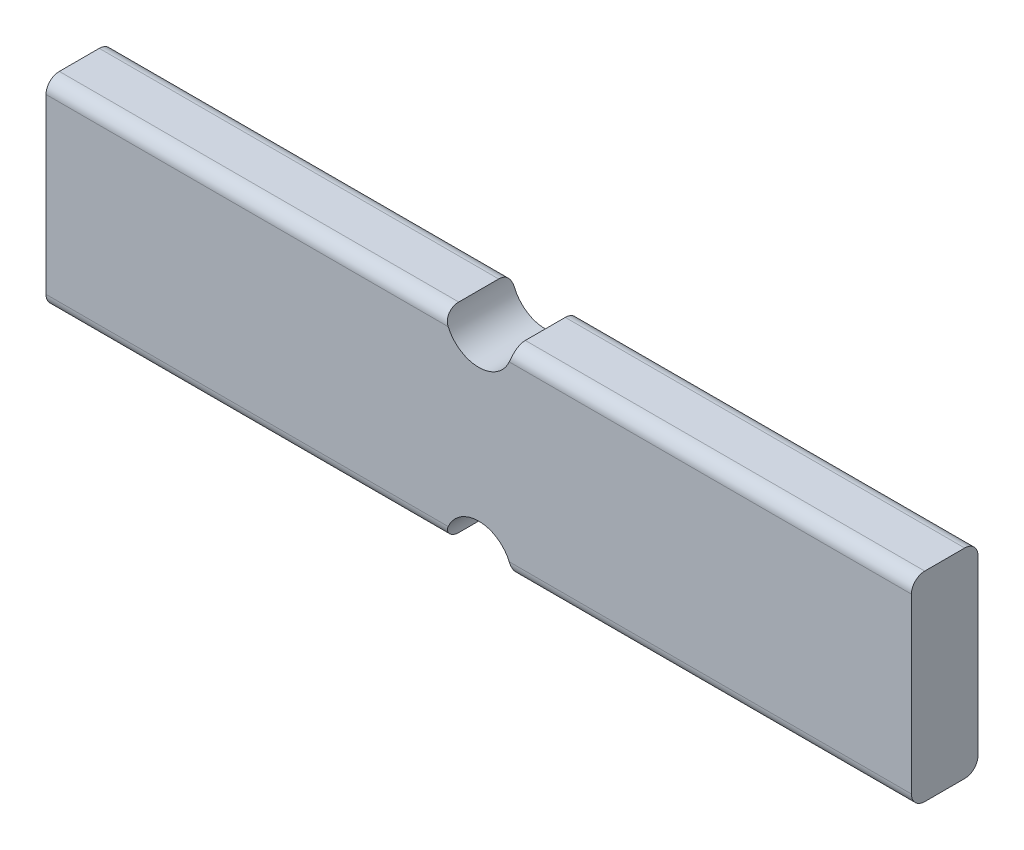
ISO-10303-21;
HEADER;
FILE_DESCRIPTION(('STEP AP214'),'2;1');
FILE_NAME('part.step','',(''),(''),'','','');
FILE_SCHEMA(('AUTOMOTIVE_DESIGN { 1 0 10303 214 1 1 1 1 }'));
ENDSEC;
DATA;
#1=APPLICATION_CONTEXT('core data for automotive mechanical design processes');
#2=APPLICATION_PROTOCOL_DEFINITION('international standard','automotive_design',2000,#1);
#3=PRODUCT_CONTEXT('',#1,'mechanical');
#4=PRODUCT('Part','Part','',(#3));
#5=PRODUCT_RELATED_PRODUCT_CATEGORY('part','',(#4));
#6=PRODUCT_DEFINITION_FORMATION('','',#4);
#7=PRODUCT_DEFINITION_CONTEXT('part definition',#1,'design');
#8=PRODUCT_DEFINITION('design','',#6,#7);
#9=PRODUCT_DEFINITION_SHAPE('','',#8);
#10=(LENGTH_UNIT() NAMED_UNIT(*) SI_UNIT(.MILLI.,.METRE.));
#11=(NAMED_UNIT(*) PLANE_ANGLE_UNIT() SI_UNIT($,.RADIAN.));
#12=(NAMED_UNIT(*) SI_UNIT($,.STERADIAN.) SOLID_ANGLE_UNIT());
#13=UNCERTAINTY_MEASURE_WITH_UNIT(LENGTH_MEASURE(1.E-05),#10,'distance_accuracy_value','');
#14=(GEOMETRIC_REPRESENTATION_CONTEXT(3) GLOBAL_UNCERTAINTY_ASSIGNED_CONTEXT((#13)) GLOBAL_UNIT_ASSIGNED_CONTEXT((#10,
#11,#12)) REPRESENTATION_CONTEXT('',''));
#15=CARTESIAN_POINT('',(0.,0.,0.));
#16=DIRECTION('',(0.,0.,1.));
#17=DIRECTION('',(1.,0.,0.));
#18=AXIS2_PLACEMENT_3D('',#15,#16,#17);
#19=CARTESIAN_POINT('',(0.,0.,12.7));
#20=DIRECTION('',(1.,0.,0.));
#21=DIRECTION('',(0.,0.,-1.));
#22=AXIS2_PLACEMENT_3D('',#19,#20,#21);
#23=PLANE('',#22);
#24=DIRECTION('',(0.,-1.,0.));
#25=VECTOR('',#24,1.);
#26=CARTESIAN_POINT('',(0.,0.,0.));
#27=LINE('',#26,#25);
#28=CARTESIAN_POINT('',(0.,35.56,0.));
#29=VERTEX_POINT('',#28);
#30=CARTESIAN_POINT('',(0.,2.54,0.));
#31=VERTEX_POINT('',#30);
#32=EDGE_CURVE('E258',#29,#31,#27,.T.);
#33=ORIENTED_EDGE('',*,*,#32,.T.);
#34=CARTESIAN_POINT('',(0.,2.54,2.54));
#35=DIRECTION('',(1.,0.,0.));
#36=DIRECTION('',(0.,0.,-1.));
#37=AXIS2_PLACEMENT_3D('',#34,#35,#36);
#38=CIRCLE('',#37,2.54);
#39=CARTESIAN_POINT('',(0.,0.,2.54));
#40=VERTEX_POINT('',#39);
#41=EDGE_CURVE('E261',#31,#40,#38,.F.);
#42=ORIENTED_EDGE('',*,*,#41,.T.);
#43=DIRECTION('',(0.,0.,-1.));
#44=VECTOR('',#43,1.);
#45=CARTESIAN_POINT('',(0.,0.,12.7));
#46=LINE('',#45,#44);
#47=CARTESIAN_POINT('',(0.,0.,10.16));
#48=VERTEX_POINT('',#47);
#49=EDGE_CURVE('E178',#48,#40,#46,.T.);
#50=ORIENTED_EDGE('',*,*,#49,.F.);
#51=CARTESIAN_POINT('',(0.,2.54,10.16));
#52=DIRECTION('',(1.,0.,0.));
#53=DIRECTION('',(0.,0.,-1.));
#54=AXIS2_PLACEMENT_3D('',#51,#52,#53);
#55=CIRCLE('',#54,2.54);
#56=CARTESIAN_POINT('',(0.,2.54,12.7));
#57=VERTEX_POINT('',#56);
#58=EDGE_CURVE('E273',#48,#57,#55,.F.);
#59=ORIENTED_EDGE('',*,*,#58,.T.);
#60=DIRECTION('',(0.,-1.,0.));
#61=VECTOR('',#60,1.);
#62=CARTESIAN_POINT('',(0.,0.,12.7));
#63=LINE('',#62,#61);
#64=CARTESIAN_POINT('',(0.,35.56,12.7));
#65=VERTEX_POINT('',#64);
#66=EDGE_CURVE('E367',#65,#57,#63,.T.);
#67=ORIENTED_EDGE('',*,*,#66,.F.);
#68=CARTESIAN_POINT('',(0.,35.56,10.16));
#69=DIRECTION('',(1.,0.,0.));
#70=DIRECTION('',(0.,0.,-1.));
#71=AXIS2_PLACEMENT_3D('',#68,#69,#70);
#72=CIRCLE('',#71,2.54);
#73=CARTESIAN_POINT('',(0.,38.1,10.16));
#74=VERTEX_POINT('',#73);
#75=EDGE_CURVE('E362',#65,#74,#72,.F.);
#76=ORIENTED_EDGE('',*,*,#75,.T.);
#77=DIRECTION('',(0.,0.,-1.));
#78=VECTOR('',#77,1.);
#79=CARTESIAN_POINT('',(0.,38.1,12.7));
#80=LINE('',#79,#78);
#81=CARTESIAN_POINT('',(0.,38.1,2.54));
#82=VERTEX_POINT('',#81);
#83=EDGE_CURVE('E344',#74,#82,#80,.T.);
#84=ORIENTED_EDGE('',*,*,#83,.T.);
#85=CARTESIAN_POINT('',(0.,35.56,2.54));
#86=DIRECTION('',(1.,0.,0.));
#87=DIRECTION('',(0.,0.,-1.));
#88=AXIS2_PLACEMENT_3D('',#85,#86,#87);
#89=CIRCLE('',#88,2.54);
#90=EDGE_CURVE('E263',#82,#29,#89,.F.);
#91=ORIENTED_EDGE('',*,*,#90,.T.);
#92=EDGE_LOOP('',(#33,#42,#50,#59,#67,#76,#84,#91));
#93=FACE_BOUND('',#92,.T.);
#94=ADVANCED_FACE('F35',(#93),#23,.F.);
#95=CARTESIAN_POINT('',(0.,0.,12.7));
#96=DIRECTION('',(0.,1.,0.));
#97=DIRECTION('',(0.,0.,1.));
#98=AXIS2_PLACEMENT_3D('',#95,#96,#97);
#99=PLANE('',#98);
#100=ORIENTED_EDGE('',*,*,#49,.T.);
#101=DIRECTION('',(1.,0.,0.));
#102=VECTOR('',#101,1.);
#103=CARTESIAN_POINT('',(0.,0.,2.54));
#104=LINE('',#103,#102);
#105=CARTESIAN_POINT('',(76.2,0.,2.54));
#106=VERTEX_POINT('',#105);
#107=EDGE_CURVE('E271',#40,#106,#104,.T.);
#108=ORIENTED_EDGE('',*,*,#107,.T.);
#109=DIRECTION('',(0.,0.,-1.));
#110=VECTOR('',#109,1.);
#111=CARTESIAN_POINT('',(76.2,0.,12.7));
#112=LINE('',#111,#110);
#113=CARTESIAN_POINT('',(76.2,0.,10.16));
#114=VERTEX_POINT('',#113);
#115=EDGE_CURVE('E183',#114,#106,#112,.T.);
#116=ORIENTED_EDGE('',*,*,#115,.F.);
#117=DIRECTION('',(1.,0.,0.));
#118=VECTOR('',#117,1.);
#119=CARTESIAN_POINT('',(0.,0.,10.16));
#120=LINE('',#119,#118);
#121=EDGE_CURVE('E359',#114,#48,#120,.F.);
#122=ORIENTED_EDGE('',*,*,#121,.T.);
#123=EDGE_LOOP('',(#100,#108,#116,#122));
#124=FACE_BOUND('',#123,.T.);
#125=ADVANCED_FACE('F218',(#124),#99,.F.);
#126=CARTESIAN_POINT('',(82.55,0.,12.7));
#127=DIRECTION('',(0.,0.,-1.));
#128=DIRECTION('',(-1.,0.,0.));
#129=AXIS2_PLACEMENT_3D('',#126,#127,#128);
#130=CYLINDRICAL_SURFACE('',#129,6.34999999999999);
#131=CARTESIAN_POINT('',(82.55,0.,0.));
#132=DIRECTION('',(0.,0.,-1.));
#133=DIRECTION('',(1.,0.,0.));
#134=AXIS2_PLACEMENT_3D('',#131,#132,#133);
#135=CIRCLE('',#134,6.34999999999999);
#136=CARTESIAN_POINT('',(76.7301288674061,2.54,0.));
#137=VERTEX_POINT('',#136);
#138=CARTESIAN_POINT('',(88.3698711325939,2.54,0.));
#139=VERTEX_POINT('',#138);
#140=EDGE_CURVE('E266',#137,#139,#135,.T.);
#141=ORIENTED_EDGE('',*,*,#140,.T.);
#142=CARTESIAN_POINT('',(88.3698711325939,2.54,0.));
#143=CARTESIAN_POINT('',(88.3982470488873,2.47500677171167,-7.07022953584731E-06));
#144=CARTESIAN_POINT('',(88.4255214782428,2.40951933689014,0.00249496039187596));
#145=CARTESIAN_POINT('',(88.4777493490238,2.27799575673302,0.0126895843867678));
#146=CARTESIAN_POINT('',(88.5027018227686,2.21195939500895,0.0203843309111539));
#147=CARTESIAN_POINT('',(88.5501563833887,2.07979790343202,0.0411424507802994));
#148=CARTESIAN_POINT('',(88.5726571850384,2.01367274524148,0.0542086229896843));
#149=CARTESIAN_POINT('',(88.6151136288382,1.88193975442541,0.0857887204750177));
#150=CARTESIAN_POINT('',(88.6350696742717,1.81633184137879,0.104301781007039));
#151=CARTESIAN_POINT('',(88.6911804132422,1.6207226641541,0.168224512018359));
#152=CARTESIAN_POINT('',(88.723482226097,1.49220517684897,0.221976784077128));
#153=CARTESIAN_POINT('',(88.7781844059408,1.2443372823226,0.350850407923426));
#154=CARTESIAN_POINT('',(88.8005949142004,1.12497759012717,0.425949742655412));
#155=CARTESIAN_POINT('',(88.8362768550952,0.904028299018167,0.592293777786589));
#156=CARTESIAN_POINT('',(88.8498732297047,0.801924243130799,0.68278681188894));
#157=CARTESIAN_POINT('',(88.8710367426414,0.613219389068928,0.879368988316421));
#158=CARTESIAN_POINT('',(88.8786009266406,0.526626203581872,0.985465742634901));
#159=CARTESIAN_POINT('',(88.8896742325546,0.370483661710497,1.21185604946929));
#160=CARTESIAN_POINT('',(88.8931268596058,0.301181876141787,1.33232291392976));
#161=CARTESIAN_POINT('',(88.8976351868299,0.183130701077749,1.58294682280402));
#162=CARTESIAN_POINT('',(88.8986913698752,0.134377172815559,1.71310190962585));
#163=CARTESIAN_POINT('',(88.8997519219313,0.0645562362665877,1.95904725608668));
#164=CARTESIAN_POINT('',(88.8998933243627,0.0403796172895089,2.07395930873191));
#165=CARTESIAN_POINT('',(88.8999839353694,0.0161710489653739,2.24790357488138));
#166=CARTESIAN_POINT('',(88.8999938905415,0.0101109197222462,2.30614737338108));
#167=CARTESIAN_POINT('',(88.9000003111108,0.00202487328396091,2.42292189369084));
#168=CARTESIAN_POINT('',(88.8999967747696,-5.23935691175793E-07,2.48145265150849));
#169=CARTESIAN_POINT('',(88.9,0.,2.54));
#170=B_SPLINE_CURVE_WITH_KNOTS('',3,(#142,#143,#144,#145,#146,#147,#148,#149,#150,#151,#152,
#153,#154,#155,#156,#157,#158,#159,#160,#161,#162,#163,#164,#165,#166,#167,#168,#169),
.UNSPECIFIED.,.F.,.F.,(4,2,2,2,2,2,2,2,2,2,2,2,2,4),(0.,0.212715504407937,0.425519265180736,
0.638434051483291,0.851315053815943,1.27793134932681,1.70410922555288,2.1135158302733,
2.52312282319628,2.93829537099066,3.35338425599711,3.70449087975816,3.88004227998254,
4.05561630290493),.UNSPECIFIED.);
#171=CARTESIAN_POINT('',(88.9,0.,2.54));
#172=VERTEX_POINT('',#171);
#173=EDGE_CURVE('E231',#139,#172,#170,.T.);
#174=ORIENTED_EDGE('',*,*,#173,.T.);
#175=DIRECTION('',(0.,0.,-1.));
#176=VECTOR('',#175,1.);
#177=CARTESIAN_POINT('',(88.9,0.,12.7));
#178=LINE('',#177,#176);
#179=CARTESIAN_POINT('',(88.9,0.,10.16));
#180=VERTEX_POINT('',#179);
#181=EDGE_CURVE('E172',#180,#172,#178,.T.);
#182=ORIENTED_EDGE('',*,*,#181,.F.);
#183=CARTESIAN_POINT('',(88.9,0.,10.16));
#184=CARTESIAN_POINT('',(88.8999910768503,-6.78863674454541E-06,10.2313283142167));
#185=CARTESIAN_POINT('',(88.8999997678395,0.00300454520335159,10.3026533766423));
#186=CARTESIAN_POINT('',(88.8999874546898,0.0150108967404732,10.4447952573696));
#187=CARTESIAN_POINT('',(88.8999664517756,0.024005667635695,10.5156120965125));
#188=CARTESIAN_POINT('',(88.8998298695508,0.0479207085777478,10.6562086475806));
#189=CARTESIAN_POINT('',(88.8997143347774,0.0628381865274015,10.7259888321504));
#190=CARTESIAN_POINT('',(88.899261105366,0.0984775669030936,10.8640289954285));
#191=CARTESIAN_POINT('',(88.8989234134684,0.119199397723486,10.9322889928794));
#192=CARTESIAN_POINT('',(88.8973376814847,0.189908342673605,11.1341426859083));
#193=CARTESIAN_POINT('',(88.8955171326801,0.248446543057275,11.2648547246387));
#194=CARTESIAN_POINT('',(88.8885986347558,0.38653944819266,11.514464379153));
#195=CARTESIAN_POINT('',(88.883501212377,0.466090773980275,11.6333638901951));
#196=CARTESIAN_POINT('',(88.8679584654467,0.64321921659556,11.8552354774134));
#197=CARTESIAN_POINT('',(88.8575487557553,0.740673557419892,11.9583077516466));
#198=CARTESIAN_POINT('',(88.8293165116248,0.950723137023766,12.1463676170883));
#199=CARTESIAN_POINT('',(88.8114973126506,1.06331154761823,12.2313633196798));
#200=CARTESIAN_POINT('',(88.7673405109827,1.29648034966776,12.3789608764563));
#201=CARTESIAN_POINT('',(88.7412443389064,1.41676518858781,12.442102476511));
#202=CARTESIAN_POINT('',(88.6794762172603,1.66379400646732,12.5478693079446));
#203=CARTESIAN_POINT('',(88.6437998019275,1.79054097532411,12.5904849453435));
#204=CARTESIAN_POINT('',(88.5704500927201,2.02201394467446,12.6489247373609));
#205=CARTESIAN_POINT('',(88.5344210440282,2.12638700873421,12.6682849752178));
#206=CARTESIAN_POINT('',(88.4759315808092,2.28230592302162,12.6874364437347));
#207=CARTESIAN_POINT('',(88.455710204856,2.33413516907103,12.6921722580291));
#208=CARTESIAN_POINT('',(88.4138435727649,2.43740586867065,12.6984542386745));
#209=CARTESIAN_POINT('',(88.3921984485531,2.48884735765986,12.7000007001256));
#210=CARTESIAN_POINT('',(88.3698711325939,2.54,12.7));
#211=B_SPLINE_CURVE_WITH_KNOTS('',3,(#183,#184,#185,#186,#187,#188,#189,#190,#191,#192,#193,
#194,#195,#196,#197,#198,#199,#200,#201,#202,#203,#204,#205,#206,#207,#208,#209,#210),
.UNSPECIFIED.,.F.,.F.,(4,2,2,2,2,2,2,2,2,2,2,2,2,4),(0.,0.213915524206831,0.427822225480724,
0.641628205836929,0.855431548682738,1.28290407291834,1.71030790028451,2.1348832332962,
2.55926764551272,2.97226337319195,3.38545195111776,3.72074992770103,3.88815894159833,
4.05555246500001),.UNSPECIFIED.);
#212=CARTESIAN_POINT('',(88.3698711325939,2.54,12.7));
#213=VERTEX_POINT('',#212);
#214=EDGE_CURVE('E177',#180,#213,#211,.T.);
#215=ORIENTED_EDGE('',*,*,#214,.T.);
#216=CARTESIAN_POINT('',(82.55,0.,12.7));
#217=DIRECTION('',(0.,0.,-1.));
#218=DIRECTION('',(1.,0.,0.));
#219=AXIS2_PLACEMENT_3D('',#216,#217,#218);
#220=CIRCLE('',#219,6.34999999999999);
#221=CARTESIAN_POINT('',(76.7301288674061,2.54,12.7));
#222=VERTEX_POINT('',#221);
#223=EDGE_CURVE('E387',#222,#213,#220,.T.);
#224=ORIENTED_EDGE('',*,*,#223,.F.);
#225=CARTESIAN_POINT('',(76.7301288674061,2.54,12.7));
#226=CARTESIAN_POINT('',(76.7017529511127,2.47500677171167,12.7000070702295));
#227=CARTESIAN_POINT('',(76.6744785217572,2.40951933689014,12.6975050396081));
#228=CARTESIAN_POINT('',(76.6222506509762,2.27799575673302,12.6873104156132));
#229=CARTESIAN_POINT('',(76.5972981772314,2.21195939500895,12.6796156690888));
#230=CARTESIAN_POINT('',(76.5498436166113,2.07979790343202,12.6588575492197));
#231=CARTESIAN_POINT('',(76.5273428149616,2.01367274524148,12.6457913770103));
#232=CARTESIAN_POINT('',(76.4848863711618,1.88193975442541,12.614211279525));
#233=CARTESIAN_POINT('',(76.4649303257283,1.81633184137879,12.595698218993));
#234=CARTESIAN_POINT('',(76.4088195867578,1.6207226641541,12.5317754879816));
#235=CARTESIAN_POINT('',(76.376517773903,1.49220517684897,12.4780232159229));
#236=CARTESIAN_POINT('',(76.3218155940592,1.2443372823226,12.3491495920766));
#237=CARTESIAN_POINT('',(76.2994050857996,1.12497759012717,12.2740502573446));
#238=CARTESIAN_POINT('',(76.2637231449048,0.904028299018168,12.1077062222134));
#239=CARTESIAN_POINT('',(76.2501267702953,0.801924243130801,12.0172131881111));
#240=CARTESIAN_POINT('',(76.2289632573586,0.61321938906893,11.8206310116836));
#241=CARTESIAN_POINT('',(76.2213990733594,0.526626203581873,11.7145342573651));
#242=CARTESIAN_POINT('',(76.2103257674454,0.370483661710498,11.4881439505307));
#243=CARTESIAN_POINT('',(76.2068731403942,0.301181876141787,11.3676770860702));
#244=CARTESIAN_POINT('',(76.20236481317,0.183130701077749,11.117053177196));
#245=CARTESIAN_POINT('',(76.2013086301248,0.134377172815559,10.9868980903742));
#246=CARTESIAN_POINT('',(76.2002480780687,0.0645562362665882,10.7409527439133));
#247=CARTESIAN_POINT('',(76.2001066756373,0.0403796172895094,10.6260406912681));
#248=CARTESIAN_POINT('',(76.2000160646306,0.0161710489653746,10.4520964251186));
#249=CARTESIAN_POINT('',(76.2000061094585,0.0101109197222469,10.3938526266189));
#250=CARTESIAN_POINT('',(76.1999996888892,0.0020248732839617,10.2770781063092));
#251=CARTESIAN_POINT('',(76.2000032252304,-5.23935690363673E-07,10.2185473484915));
#252=CARTESIAN_POINT('',(76.2,0.,10.16));
#253=B_SPLINE_CURVE_WITH_KNOTS('',3,(#225,#226,#227,#228,#229,#230,#231,#232,#233,#234,#235,
#236,#237,#238,#239,#240,#241,#242,#243,#244,#245,#246,#247,#248,#249,#250,#251,#252),
.UNSPECIFIED.,.F.,.F.,(4,2,2,2,2,2,2,2,2,2,2,2,2,4),(0.,0.212715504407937,0.425519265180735,
0.638434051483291,0.851315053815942,1.2779313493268,1.70410922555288,2.11351583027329,
2.52312282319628,2.93829537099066,3.35338425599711,3.70449087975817,3.88004227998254,
4.05561630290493),.UNSPECIFIED.);
#254=EDGE_CURVE('E198',#222,#114,#253,.T.);
#255=ORIENTED_EDGE('',*,*,#254,.T.);
#256=ORIENTED_EDGE('',*,*,#115,.T.);
#257=CARTESIAN_POINT('',(76.2,0.,2.54));
#258=CARTESIAN_POINT('',(76.2000089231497,-6.78863674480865E-06,2.46867168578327));
#259=CARTESIAN_POINT('',(76.2000002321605,0.00300454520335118,2.3973466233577));
#260=CARTESIAN_POINT('',(76.2000125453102,0.0150108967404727,2.2552047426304));
#261=CARTESIAN_POINT('',(76.2000335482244,0.0240056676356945,2.1843879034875));
#262=CARTESIAN_POINT('',(76.2001701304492,0.0479207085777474,2.04379135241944));
#263=CARTESIAN_POINT('',(76.2002856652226,0.0628381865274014,1.97401116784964));
#264=CARTESIAN_POINT('',(76.2007388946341,0.0984775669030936,1.83597100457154));
#265=CARTESIAN_POINT('',(76.2010765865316,0.119199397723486,1.7677110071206));
#266=CARTESIAN_POINT('',(76.2026623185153,0.189908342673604,1.56585731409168));
#267=CARTESIAN_POINT('',(76.2044828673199,0.248446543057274,1.43514527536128));
#268=CARTESIAN_POINT('',(76.2114013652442,0.386539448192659,1.185535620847));
#269=CARTESIAN_POINT('',(76.216498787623,0.466090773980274,1.06663610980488));
#270=CARTESIAN_POINT('',(76.2320415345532,0.64321921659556,0.844764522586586));
#271=CARTESIAN_POINT('',(76.2424512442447,0.740673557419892,0.741692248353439));
#272=CARTESIAN_POINT('',(76.2706834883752,0.950723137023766,0.553632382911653));
#273=CARTESIAN_POINT('',(76.2885026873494,1.06331154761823,0.468636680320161));
#274=CARTESIAN_POINT('',(76.3326594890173,1.29648034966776,0.321039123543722));
#275=CARTESIAN_POINT('',(76.3587556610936,1.41676518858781,0.257897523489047));
#276=CARTESIAN_POINT('',(76.4205237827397,1.66379400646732,0.152130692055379));
#277=CARTESIAN_POINT('',(76.4562001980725,1.79054097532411,0.109515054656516));
#278=CARTESIAN_POINT('',(76.5295499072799,2.02201394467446,0.0510752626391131));
#279=CARTESIAN_POINT('',(76.5655789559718,2.12638700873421,0.0317150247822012));
#280=CARTESIAN_POINT('',(76.6240684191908,2.28230592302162,0.0125635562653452));
#281=CARTESIAN_POINT('',(76.644289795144,2.33413516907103,0.0078277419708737));
#282=CARTESIAN_POINT('',(76.686156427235,2.43740586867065,0.00154576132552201));
#283=CARTESIAN_POINT('',(76.7078015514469,2.48884735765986,-7.00125593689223E-07));
#284=CARTESIAN_POINT('',(76.7301288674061,2.54,0.));
#285=B_SPLINE_CURVE_WITH_KNOTS('',3,(#257,#258,#259,#260,#261,#262,#263,#264,#265,#266,#267,
#268,#269,#270,#271,#272,#273,#274,#275,#276,#277,#278,#279,#280,#281,#282,#283,#284),
.UNSPECIFIED.,.F.,.F.,(4,2,2,2,2,2,2,2,2,2,2,2,2,4),(0.,0.213915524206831,0.427822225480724,
0.641628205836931,0.855431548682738,1.28290407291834,1.71030790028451,2.1348832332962,
2.55926764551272,2.97226337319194,3.38545195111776,3.72074992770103,3.88815894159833,
4.05555246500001),.UNSPECIFIED.);
#286=EDGE_CURVE('E226',#106,#137,#285,.T.);
#287=ORIENTED_EDGE('',*,*,#286,.T.);
#288=EDGE_LOOP('',(#141,#174,#182,#215,#224,#255,#256,#287));
#289=FACE_BOUND('',#288,.T.);
#290=ADVANCED_FACE('F213',(#289),#130,.F.);
#291=CARTESIAN_POINT('',(88.9,0.,12.7));
#292=DIRECTION('',(0.,1.,0.));
#293=DIRECTION('',(0.,0.,1.));
#294=AXIS2_PLACEMENT_3D('',#291,#292,#293);
#295=PLANE('',#294);
#296=ORIENTED_EDGE('',*,*,#181,.T.);
#297=DIRECTION('',(1.,0.,0.));
#298=VECTOR('',#297,1.);
#299=CARTESIAN_POINT('',(88.9,0.,2.54));
#300=LINE('',#299,#298);
#301=CARTESIAN_POINT('',(165.1,0.,2.54));
#302=VERTEX_POINT('',#301);
#303=EDGE_CURVE('E171',#172,#302,#300,.T.);
#304=ORIENTED_EDGE('',*,*,#303,.T.);
#305=DIRECTION('',(0.,0.,-1.));
#306=VECTOR('',#305,1.);
#307=CARTESIAN_POINT('',(165.1,0.,12.7));
#308=LINE('',#307,#306);
#309=CARTESIAN_POINT('',(165.1,0.,10.16));
#310=VERTEX_POINT('',#309);
#311=EDGE_CURVE('E154',#310,#302,#308,.T.);
#312=ORIENTED_EDGE('',*,*,#311,.F.);
#313=DIRECTION('',(1.,0.,0.));
#314=VECTOR('',#313,1.);
#315=CARTESIAN_POINT('',(88.9,0.,10.16));
#316=LINE('',#315,#314);
#317=EDGE_CURVE('E168',#310,#180,#316,.F.);
#318=ORIENTED_EDGE('',*,*,#317,.T.);
#319=EDGE_LOOP('',(#296,#304,#312,#318));
#320=FACE_BOUND('',#319,.T.);
#321=ADVANCED_FACE('F167',(#320),#295,.F.);
#322=CARTESIAN_POINT('',(165.1,0.,12.7));
#323=DIRECTION('',(-1.,0.,0.));
#324=DIRECTION('',(0.,0.,1.));
#325=AXIS2_PLACEMENT_3D('',#322,#323,#324);
#326=PLANE('',#325);
#327=ORIENTED_EDGE('',*,*,#311,.T.);
#328=CARTESIAN_POINT('',(165.1,2.54,2.54));
#329=DIRECTION('',(-1.,0.,0.));
#330=DIRECTION('',(0.,0.,1.));
#331=AXIS2_PLACEMENT_3D('',#328,#329,#330);
#332=CIRCLE('',#331,2.54);
#333=CARTESIAN_POINT('',(165.1,2.54,0.));
#334=VERTEX_POINT('',#333);
#335=EDGE_CURVE('E161',#302,#334,#332,.F.);
#336=ORIENTED_EDGE('',*,*,#335,.T.);
#337=DIRECTION('',(0.,1.,0.));
#338=VECTOR('',#337,1.);
#339=CARTESIAN_POINT('',(165.1,0.,0.));
#340=LINE('',#339,#338);
#341=CARTESIAN_POINT('',(165.1,35.56,0.));
#342=VERTEX_POINT('',#341);
#343=EDGE_CURVE('E379',#334,#342,#340,.T.);
#344=ORIENTED_EDGE('',*,*,#343,.T.);
#345=CARTESIAN_POINT('',(165.1,35.56,2.54));
#346=DIRECTION('',(-1.,0.,0.));
#347=DIRECTION('',(0.,0.,1.));
#348=AXIS2_PLACEMENT_3D('',#345,#346,#347);
#349=CIRCLE('',#348,2.54);
#350=CARTESIAN_POINT('',(165.1,38.1,2.54));
#351=VERTEX_POINT('',#350);
#352=EDGE_CURVE('E180',#342,#351,#349,.F.);
#353=ORIENTED_EDGE('',*,*,#352,.T.);
#354=DIRECTION('',(0.,0.,-1.));
#355=VECTOR('',#354,1.);
#356=CARTESIAN_POINT('',(165.1,38.1,12.7));
#357=LINE('',#356,#355);
#358=CARTESIAN_POINT('',(165.1,38.1,10.16));
#359=VERTEX_POINT('',#358);
#360=EDGE_CURVE('E173',#359,#351,#357,.T.);
#361=ORIENTED_EDGE('',*,*,#360,.F.);
#362=CARTESIAN_POINT('',(165.1,35.56,10.16));
#363=DIRECTION('',(-1.,0.,0.));
#364=DIRECTION('',(0.,0.,1.));
#365=AXIS2_PLACEMENT_3D('',#362,#363,#364);
#366=CIRCLE('',#365,2.54);
#367=CARTESIAN_POINT('',(165.1,35.56,12.7));
#368=VERTEX_POINT('',#367);
#369=EDGE_CURVE('E162',#359,#368,#366,.F.);
#370=ORIENTED_EDGE('',*,*,#369,.T.);
#371=DIRECTION('',(0.,1.,0.));
#372=VECTOR('',#371,1.);
#373=CARTESIAN_POINT('',(165.1,0.,12.7));
#374=LINE('',#373,#372);
#375=CARTESIAN_POINT('',(165.1,2.54,12.7));
#376=VERTEX_POINT('',#375);
#377=EDGE_CURVE('E156',#376,#368,#374,.T.);
#378=ORIENTED_EDGE('',*,*,#377,.F.);
#379=CARTESIAN_POINT('',(165.1,2.54,10.16));
#380=DIRECTION('',(-1.,0.,0.));
#381=DIRECTION('',(0.,0.,1.));
#382=AXIS2_PLACEMENT_3D('',#379,#380,#381);
#383=CIRCLE('',#382,2.54);
#384=EDGE_CURVE('E151',#376,#310,#383,.F.);
#385=ORIENTED_EDGE('',*,*,#384,.T.);
#386=EDGE_LOOP('',(#327,#336,#344,#353,#361,#370,#378,#385));
#387=FACE_BOUND('',#386,.T.);
#388=ADVANCED_FACE('F153',(#387),#326,.F.);
#389=CARTESIAN_POINT('',(88.9,38.1,12.7));
#390=DIRECTION('',(0.,-1.,0.));
#391=DIRECTION('',(0.,0.,-1.));
#392=AXIS2_PLACEMENT_3D('',#389,#390,#391);
#393=PLANE('',#392);
#394=DIRECTION('',(0.,0.,-1.));
#395=VECTOR('',#394,1.);
#396=CARTESIAN_POINT('',(88.9,38.1,12.7));
#397=LINE('',#396,#395);
#398=CARTESIAN_POINT('',(88.9,38.1,10.16));
#399=VERTEX_POINT('',#398);
#400=CARTESIAN_POINT('',(88.9,38.1,2.54));
#401=VERTEX_POINT('',#400);
#402=EDGE_CURVE('E343',#399,#401,#397,.T.);
#403=ORIENTED_EDGE('',*,*,#402,.F.);
#404=DIRECTION('',(-1.,0.,0.));
#405=VECTOR('',#404,1.);
#406=CARTESIAN_POINT('',(165.1,38.1,10.16));
#407=LINE('',#406,#405);
#408=EDGE_CURVE('E369',#399,#359,#407,.F.);
#409=ORIENTED_EDGE('',*,*,#408,.T.);
#410=ORIENTED_EDGE('',*,*,#360,.T.);
#411=DIRECTION('',(-1.,0.,0.));
#412=VECTOR('',#411,1.);
#413=CARTESIAN_POINT('',(88.9,38.1,2.54));
#414=LINE('',#413,#412);
#415=EDGE_CURVE('E370',#351,#401,#414,.T.);
#416=ORIENTED_EDGE('',*,*,#415,.T.);
#417=EDGE_LOOP('',(#403,#409,#410,#416));
#418=FACE_BOUND('',#417,.T.);
#419=ADVANCED_FACE('F305',(#418),#393,.F.);
#420=CARTESIAN_POINT('',(82.55,38.1,12.7));
#421=DIRECTION('',(0.,0.,-1.));
#422=DIRECTION('',(-1.,0.,0.));
#423=AXIS2_PLACEMENT_3D('',#420,#421,#422);
#424=CYLINDRICAL_SURFACE('',#423,6.34999999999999);
#425=CARTESIAN_POINT('',(82.55,38.1,12.7));
#426=DIRECTION('',(0.,0.,-1.));
#427=DIRECTION('',(1.,0.,0.));
#428=AXIS2_PLACEMENT_3D('',#425,#426,#427);
#429=CIRCLE('',#428,6.34999999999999);
#430=CARTESIAN_POINT('',(88.3698711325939,35.56,12.7));
#431=VERTEX_POINT('',#430);
#432=CARTESIAN_POINT('',(76.7301288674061,35.56,12.7));
#433=VERTEX_POINT('',#432);
#434=EDGE_CURVE('E347',#431,#433,#429,.T.);
#435=ORIENTED_EDGE('',*,*,#434,.F.);
#436=CARTESIAN_POINT('',(88.3698711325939,35.56,12.7));
#437=CARTESIAN_POINT('',(88.3982470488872,35.6249932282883,12.7000070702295));
#438=CARTESIAN_POINT('',(88.4255214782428,35.6904806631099,12.6975050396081));
#439=CARTESIAN_POINT('',(88.4777493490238,35.822004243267,12.6873104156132));
#440=CARTESIAN_POINT('',(88.5027018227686,35.8880406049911,12.6796156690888));
#441=CARTESIAN_POINT('',(88.5501563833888,36.020202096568,12.6588575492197));
#442=CARTESIAN_POINT('',(88.5726571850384,36.0863272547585,12.6457913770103));
#443=CARTESIAN_POINT('',(88.6151136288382,36.2180602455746,12.614211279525));
#444=CARTESIAN_POINT('',(88.6350696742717,36.2836681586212,12.595698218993));
#445=CARTESIAN_POINT('',(88.6911804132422,36.4792773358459,12.5317754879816));
#446=CARTESIAN_POINT('',(88.723482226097,36.607794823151,12.4780232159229));
#447=CARTESIAN_POINT('',(88.7781844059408,36.8556627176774,12.3491495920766));
#448=CARTESIAN_POINT('',(88.8005949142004,36.9750224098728,12.2740502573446));
#449=CARTESIAN_POINT('',(88.8362768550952,37.1959717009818,12.1077062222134));
#450=CARTESIAN_POINT('',(88.8498732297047,37.2980757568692,12.0172131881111));
#451=CARTESIAN_POINT('',(88.8710367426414,37.4867806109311,11.8206310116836));
#452=CARTESIAN_POINT('',(88.8786009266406,37.5733737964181,11.7145342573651));
#453=CARTESIAN_POINT('',(88.8896742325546,37.7295163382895,11.4881439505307));
#454=CARTESIAN_POINT('',(88.8931268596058,37.7988181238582,11.3676770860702));
#455=CARTESIAN_POINT('',(88.8976351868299,37.9168692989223,11.117053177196));
#456=CARTESIAN_POINT('',(88.8986913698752,37.9656228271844,10.9868980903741));
#457=CARTESIAN_POINT('',(88.8997519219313,38.0354437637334,10.7409527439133));
#458=CARTESIAN_POINT('',(88.8998933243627,38.0596203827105,10.6260406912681));
#459=CARTESIAN_POINT('',(88.8999839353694,38.0838289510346,10.4520964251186));
#460=CARTESIAN_POINT('',(88.8999938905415,38.0898890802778,10.3938526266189));
#461=CARTESIAN_POINT('',(88.9000003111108,38.097975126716,10.2770781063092));
#462=CARTESIAN_POINT('',(88.8999967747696,38.1000005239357,10.2185473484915));
#463=CARTESIAN_POINT('',(88.9,38.1,10.16));
#464=B_SPLINE_CURVE_WITH_KNOTS('',3,(#436,#437,#438,#439,#440,#441,#442,#443,#444,#445,#446,
#447,#448,#449,#450,#451,#452,#453,#454,#455,#456,#457,#458,#459,#460,#461,#462,#463),
.UNSPECIFIED.,.F.,.F.,(4,2,2,2,2,2,2,2,2,2,2,2,2,4),(0.,0.212715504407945,0.425519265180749,
0.638434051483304,0.851315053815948,1.2779313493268,1.70410922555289,2.1135158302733,
2.52312282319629,2.93829537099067,3.35338425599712,3.70449087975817,3.88004227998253,
4.05561630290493),.UNSPECIFIED.);
#465=EDGE_CURVE('E59',#431,#399,#464,.T.);
#466=ORIENTED_EDGE('',*,*,#465,.T.);
#467=ORIENTED_EDGE('',*,*,#402,.T.);
#468=CARTESIAN_POINT('',(88.9,38.1,2.54));
#469=CARTESIAN_POINT('',(88.8999910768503,38.1000067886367,2.46867168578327));
#470=CARTESIAN_POINT('',(88.8999997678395,38.0969954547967,2.3973466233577));
#471=CARTESIAN_POINT('',(88.8999874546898,38.0849891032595,2.2552047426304));
#472=CARTESIAN_POINT('',(88.8999664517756,38.0759943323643,2.1843879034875));
#473=CARTESIAN_POINT('',(88.8998298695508,38.0520792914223,2.04379135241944));
#474=CARTESIAN_POINT('',(88.8997143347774,38.0371618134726,1.97401116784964));
#475=CARTESIAN_POINT('',(88.899261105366,38.0015224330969,1.83597100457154));
#476=CARTESIAN_POINT('',(88.8989234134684,37.9808006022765,1.7677110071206));
#477=CARTESIAN_POINT('',(88.8973376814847,37.9100916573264,1.56585731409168));
#478=CARTESIAN_POINT('',(88.8955171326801,37.8515534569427,1.43514527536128));
#479=CARTESIAN_POINT('',(88.8885986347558,37.7134605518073,1.18553562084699));
#480=CARTESIAN_POINT('',(88.883501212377,37.6339092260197,1.06663610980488));
#481=CARTESIAN_POINT('',(88.8679584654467,37.4567807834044,0.844764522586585));
#482=CARTESIAN_POINT('',(88.8575487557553,37.3593264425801,0.741692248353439));
#483=CARTESIAN_POINT('',(88.8293165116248,37.1492768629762,0.553632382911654));
#484=CARTESIAN_POINT('',(88.8114973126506,37.0366884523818,0.468636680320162));
#485=CARTESIAN_POINT('',(88.7673405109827,36.8035196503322,0.321039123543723));
#486=CARTESIAN_POINT('',(88.7412443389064,36.6832348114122,0.257897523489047));
#487=CARTESIAN_POINT('',(88.6794762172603,36.4362059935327,0.152130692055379));
#488=CARTESIAN_POINT('',(88.6437998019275,36.3094590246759,0.109515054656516));
#489=CARTESIAN_POINT('',(88.5704500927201,36.0779860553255,0.0510752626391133));
#490=CARTESIAN_POINT('',(88.5344210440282,35.9736129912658,0.0317150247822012));
#491=CARTESIAN_POINT('',(88.4759315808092,35.8176940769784,0.0125635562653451));
#492=CARTESIAN_POINT('',(88.455710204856,35.765864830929,0.00782774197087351));
#493=CARTESIAN_POINT('',(88.4138435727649,35.6625941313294,0.00154576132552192));
#494=CARTESIAN_POINT('',(88.3921984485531,35.6111526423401,-7.00125593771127E-07));
#495=CARTESIAN_POINT('',(88.3698711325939,35.56,0.));
#496=B_SPLINE_CURVE_WITH_KNOTS('',3,(#468,#469,#470,#471,#472,#473,#474,#475,#476,#477,#478,
#479,#480,#481,#482,#483,#484,#485,#486,#487,#488,#489,#490,#491,#492,#493,#494,#495),
.UNSPECIFIED.,.F.,.F.,(4,2,2,2,2,2,2,2,2,2,2,2,2,4),(0.,0.213915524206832,0.427822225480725,
0.641628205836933,0.855431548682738,1.28290407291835,1.71030790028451,2.1348832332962,
2.55926764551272,2.97226337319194,3.38545195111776,3.72074992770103,3.88815894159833,
4.055552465),.UNSPECIFIED.);
#497=CARTESIAN_POINT('',(88.3698711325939,35.56,0.));
#498=VERTEX_POINT('',#497);
#499=EDGE_CURVE('E51',#401,#498,#496,.T.);
#500=ORIENTED_EDGE('',*,*,#499,.T.);
#501=CARTESIAN_POINT('',(82.55,38.1,0.));
#502=DIRECTION('',(0.,0.,-1.));
#503=DIRECTION('',(1.,0.,0.));
#504=AXIS2_PLACEMENT_3D('',#501,#502,#503);
#505=CIRCLE('',#504,6.34999999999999);
#506=CARTESIAN_POINT('',(76.7301288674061,35.56,0.));
#507=VERTEX_POINT('',#506);
#508=EDGE_CURVE('E339',#498,#507,#505,.T.);
#509=ORIENTED_EDGE('',*,*,#508,.T.);
#510=CARTESIAN_POINT('',(76.7301288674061,35.56,0.));
#511=CARTESIAN_POINT('',(76.7017529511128,35.6249932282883,-7.07022953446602E-06));
#512=CARTESIAN_POINT('',(76.6744785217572,35.6904806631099,0.00249496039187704));
#513=CARTESIAN_POINT('',(76.6222506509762,35.822004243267,0.0126895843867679));
#514=CARTESIAN_POINT('',(76.5972981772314,35.8880406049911,0.0203843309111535));
#515=CARTESIAN_POINT('',(76.5498436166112,36.020202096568,0.0411424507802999));
#516=CARTESIAN_POINT('',(76.5273428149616,36.0863272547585,0.054208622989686));
#517=CARTESIAN_POINT('',(76.4848863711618,36.2180602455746,0.0857887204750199));
#518=CARTESIAN_POINT('',(76.4649303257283,36.2836681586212,0.10430178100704));
#519=CARTESIAN_POINT('',(76.4088195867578,36.4792773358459,0.16822451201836));
#520=CARTESIAN_POINT('',(76.376517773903,36.607794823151,0.221976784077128));
#521=CARTESIAN_POINT('',(76.3218155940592,36.8556627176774,0.350850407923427));
#522=CARTESIAN_POINT('',(76.2994050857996,36.9750224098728,0.425949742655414));
#523=CARTESIAN_POINT('',(76.2637231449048,37.1959717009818,0.592293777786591));
#524=CARTESIAN_POINT('',(76.2501267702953,37.2980757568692,0.682786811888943));
#525=CARTESIAN_POINT('',(76.2289632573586,37.4867806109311,0.879368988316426));
#526=CARTESIAN_POINT('',(76.2213990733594,37.5733737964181,0.985465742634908));
#527=CARTESIAN_POINT('',(76.2103257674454,37.7295163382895,1.2118560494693));
#528=CARTESIAN_POINT('',(76.2068731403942,37.7988181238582,1.33232291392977));
#529=CARTESIAN_POINT('',(76.20236481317,37.9168692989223,1.58294682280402));
#530=CARTESIAN_POINT('',(76.2013086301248,37.9656228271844,1.71310190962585));
#531=CARTESIAN_POINT('',(76.2002480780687,38.0354437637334,1.95904725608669));
#532=CARTESIAN_POINT('',(76.2001066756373,38.0596203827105,2.07395930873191));
#533=CARTESIAN_POINT('',(76.2000160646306,38.0838289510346,2.24790357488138));
#534=CARTESIAN_POINT('',(76.2000061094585,38.0898890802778,2.30614737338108));
#535=CARTESIAN_POINT('',(76.1999996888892,38.097975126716,2.42292189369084));
#536=CARTESIAN_POINT('',(76.2000032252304,38.1000005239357,2.48145265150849));
#537=CARTESIAN_POINT('',(76.2,38.1,2.54));
#538=B_SPLINE_CURVE_WITH_KNOTS('',3,(#510,#511,#512,#513,#514,#515,#516,#517,#518,#519,#520,
#521,#522,#523,#524,#525,#526,#527,#528,#529,#530,#531,#532,#533,#534,#535,#536,#537),
.UNSPECIFIED.,.F.,.F.,(4,2,2,2,2,2,2,2,2,2,2,2,2,4),(0.,0.212715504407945,0.425519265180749,
0.638434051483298,0.851315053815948,1.2779313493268,1.70410922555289,2.1135158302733,
2.52312282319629,2.93829537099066,3.35338425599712,3.70449087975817,3.88004227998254,
4.05561630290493),.UNSPECIFIED.);
#539=CARTESIAN_POINT('',(76.2,38.1,2.54));
#540=VERTEX_POINT('',#539);
#541=EDGE_CURVE('E294',#507,#540,#538,.T.);
#542=ORIENTED_EDGE('',*,*,#541,.T.);
#543=DIRECTION('',(0.,0.,-1.));
#544=VECTOR('',#543,1.);
#545=CARTESIAN_POINT('',(76.2,38.1,12.7));
#546=LINE('',#545,#544);
#547=CARTESIAN_POINT('',(76.2,38.1,10.16));
#548=VERTEX_POINT('',#547);
#549=EDGE_CURVE('E336',#548,#540,#546,.T.);
#550=ORIENTED_EDGE('',*,*,#549,.F.);
#551=CARTESIAN_POINT('',(76.2,38.1,10.16));
#552=CARTESIAN_POINT('',(76.2000089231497,38.1000067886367,10.2313283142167));
#553=CARTESIAN_POINT('',(76.2000002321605,38.0969954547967,10.3026533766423));
#554=CARTESIAN_POINT('',(76.2000125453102,38.0849891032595,10.4447952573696));
#555=CARTESIAN_POINT('',(76.2000335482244,38.0759943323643,10.5156120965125));
#556=CARTESIAN_POINT('',(76.2001701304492,38.0520792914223,10.6562086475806));
#557=CARTESIAN_POINT('',(76.2002856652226,38.0371618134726,10.7259888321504));
#558=CARTESIAN_POINT('',(76.2007388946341,38.0015224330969,10.8640289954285));
#559=CARTESIAN_POINT('',(76.2010765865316,37.9808006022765,10.9322889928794));
#560=CARTESIAN_POINT('',(76.2026623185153,37.9100916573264,11.1341426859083));
#561=CARTESIAN_POINT('',(76.2044828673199,37.8515534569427,11.2648547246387));
#562=CARTESIAN_POINT('',(76.2114013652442,37.7134605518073,11.514464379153));
#563=CARTESIAN_POINT('',(76.216498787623,37.6339092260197,11.6333638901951));
#564=CARTESIAN_POINT('',(76.2320415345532,37.4567807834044,11.8552354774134));
#565=CARTESIAN_POINT('',(76.2424512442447,37.3593264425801,11.9583077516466));
#566=CARTESIAN_POINT('',(76.2706834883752,37.1492768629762,12.1463676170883));
#567=CARTESIAN_POINT('',(76.2885026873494,37.0366884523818,12.2313633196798));
#568=CARTESIAN_POINT('',(76.3326594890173,36.8035196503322,12.3789608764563));
#569=CARTESIAN_POINT('',(76.3587556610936,36.6832348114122,12.442102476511));
#570=CARTESIAN_POINT('',(76.4205237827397,36.4362059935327,12.5478693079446));
#571=CARTESIAN_POINT('',(76.4562001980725,36.3094590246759,12.5904849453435));
#572=CARTESIAN_POINT('',(76.5295499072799,36.0779860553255,12.6489247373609));
#573=CARTESIAN_POINT('',(76.5655789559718,35.9736129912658,12.6682849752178));
#574=CARTESIAN_POINT('',(76.6240684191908,35.8176940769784,12.6874364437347));
#575=CARTESIAN_POINT('',(76.644289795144,35.765864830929,12.6921722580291));
#576=CARTESIAN_POINT('',(76.686156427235,35.6625941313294,12.6984542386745));
#577=CARTESIAN_POINT('',(76.7078015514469,35.6111526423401,12.7000007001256));
#578=CARTESIAN_POINT('',(76.7301288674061,35.56,12.7));
#579=B_SPLINE_CURVE_WITH_KNOTS('',3,(#551,#552,#553,#554,#555,#556,#557,#558,#559,#560,#561,
#562,#563,#564,#565,#566,#567,#568,#569,#570,#571,#572,#573,#574,#575,#576,#577,#578),
.UNSPECIFIED.,.F.,.F.,(4,2,2,2,2,2,2,2,2,2,2,2,2,4),(0.,0.213915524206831,0.427822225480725,
0.641628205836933,0.855431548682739,1.28290407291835,1.71030790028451,2.1348832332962,
2.55926764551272,2.97226337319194,3.38545195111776,3.72074992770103,3.88815894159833,
4.055552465),.UNSPECIFIED.);
#580=EDGE_CURVE('E288',#548,#433,#579,.T.);
#581=ORIENTED_EDGE('',*,*,#580,.T.);
#582=EDGE_LOOP('',(#435,#466,#467,#500,#509,#542,#550,#581));
#583=FACE_BOUND('',#582,.T.);
#584=ADVANCED_FACE('F299',(#583),#424,.F.);
#585=CARTESIAN_POINT('',(0.,38.1,12.7));
#586=DIRECTION('',(0.,-1.,0.));
#587=DIRECTION('',(0.,0.,-1.));
#588=AXIS2_PLACEMENT_3D('',#585,#586,#587);
#589=PLANE('',#588);
#590=ORIENTED_EDGE('',*,*,#549,.T.);
#591=DIRECTION('',(-1.,0.,0.));
#592=VECTOR('',#591,1.);
#593=CARTESIAN_POINT('',(0.,38.1,2.54));
#594=LINE('',#593,#592);
#595=EDGE_CURVE('E11',#540,#82,#594,.T.);
#596=ORIENTED_EDGE('',*,*,#595,.T.);
#597=ORIENTED_EDGE('',*,*,#83,.F.);
#598=DIRECTION('',(-1.,0.,0.));
#599=VECTOR('',#598,1.);
#600=CARTESIAN_POINT('',(76.2,38.1,10.16));
#601=LINE('',#600,#599);
#602=EDGE_CURVE('E44',#74,#548,#601,.F.);
#603=ORIENTED_EDGE('',*,*,#602,.T.);
#604=EDGE_LOOP('',(#590,#596,#597,#603));
#605=FACE_BOUND('',#604,.T.);
#606=ADVANCED_FACE('F304',(#605),#589,.F.);
#607=CARTESIAN_POINT('',(82.55,38.1,12.7));
#608=DIRECTION('',(0.,0.,1.));
#609=DIRECTION('',(1.,0.,0.));
#610=AXIS2_PLACEMENT_3D('',#607,#608,#609);
#611=PLANE('',#610);
#612=ORIENTED_EDGE('',*,*,#223,.T.);
#613=DIRECTION('',(1.,0.,0.));
#614=VECTOR('',#613,1.);
#615=CARTESIAN_POINT('',(165.1,2.54,12.7));
#616=LINE('',#615,#614);
#617=EDGE_CURVE('E286',#213,#376,#616,.T.);
#618=ORIENTED_EDGE('',*,*,#617,.T.);
#619=ORIENTED_EDGE('',*,*,#377,.T.);
#620=DIRECTION('',(-1.,0.,0.));
#621=VECTOR('',#620,1.);
#622=CARTESIAN_POINT('',(88.9,35.56,12.7));
#623=LINE('',#622,#621);
#624=EDGE_CURVE('E276',#368,#431,#623,.T.);
#625=ORIENTED_EDGE('',*,*,#624,.T.);
#626=ORIENTED_EDGE('',*,*,#434,.T.);
#627=DIRECTION('',(-1.,0.,0.));
#628=VECTOR('',#627,1.);
#629=CARTESIAN_POINT('',(0.,35.56,12.7));
#630=LINE('',#629,#628);
#631=EDGE_CURVE('E272',#433,#65,#630,.T.);
#632=ORIENTED_EDGE('',*,*,#631,.T.);
#633=ORIENTED_EDGE('',*,*,#66,.T.);
#634=DIRECTION('',(1.,0.,0.));
#635=VECTOR('',#634,1.);
#636=CARTESIAN_POINT('',(76.2,2.54,12.7));
#637=LINE('',#636,#635);
#638=EDGE_CURVE('E283',#57,#222,#637,.T.);
#639=ORIENTED_EDGE('',*,*,#638,.T.);
#640=EDGE_LOOP('',(#612,#618,#619,#625,#626,#632,#633,#639));
#641=FACE_BOUND('',#640,.T.);
#642=ADVANCED_FACE('F392',(#641),#611,.T.);
#643=CARTESIAN_POINT('',(82.55,38.1,0.));
#644=DIRECTION('',(0.,0.,1.));
#645=DIRECTION('',(1.,0.,0.));
#646=AXIS2_PLACEMENT_3D('',#643,#644,#645);
#647=PLANE('',#646);
#648=ORIENTED_EDGE('',*,*,#343,.F.);
#649=DIRECTION('',(1.,0.,0.));
#650=VECTOR('',#649,1.);
#651=CARTESIAN_POINT('',(82.55,2.54,0.));
#652=LINE('',#651,#650);
#653=EDGE_CURVE('E196',#334,#139,#652,.F.);
#654=ORIENTED_EDGE('',*,*,#653,.T.);
#655=ORIENTED_EDGE('',*,*,#140,.F.);
#656=DIRECTION('',(1.,0.,0.));
#657=VECTOR('',#656,1.);
#658=CARTESIAN_POINT('',(82.55,2.54,0.));
#659=LINE('',#658,#657);
#660=EDGE_CURVE('E194',#137,#31,#659,.F.);
#661=ORIENTED_EDGE('',*,*,#660,.T.);
#662=ORIENTED_EDGE('',*,*,#32,.F.);
#663=DIRECTION('',(-1.,0.,0.));
#664=VECTOR('',#663,1.);
#665=CARTESIAN_POINT('',(82.55,35.56,0.));
#666=LINE('',#665,#664);
#667=EDGE_CURVE('E190',#29,#507,#666,.F.);
#668=ORIENTED_EDGE('',*,*,#667,.T.);
#669=ORIENTED_EDGE('',*,*,#508,.F.);
#670=DIRECTION('',(-1.,0.,0.));
#671=VECTOR('',#670,1.);
#672=CARTESIAN_POINT('',(82.55,35.56,0.));
#673=LINE('',#672,#671);
#674=EDGE_CURVE('E192',#498,#342,#673,.F.);
#675=ORIENTED_EDGE('',*,*,#674,.T.);
#676=EDGE_LOOP('',(#648,#654,#655,#661,#662,#668,#669,#675));
#677=FACE_BOUND('',#676,.T.);
#678=ADVANCED_FACE('F377',(#677),#647,.F.);
#679=CARTESIAN_POINT('',(88.9,2.54,2.54));
#680=DIRECTION('',(1.,0.,0.));
#681=DIRECTION('',(0.,0.,-1.));
#682=AXIS2_PLACEMENT_3D('',#679,#680,#681);
#683=CYLINDRICAL_SURFACE('',#682,2.54);
#684=ORIENTED_EDGE('',*,*,#173,.F.);
#685=ORIENTED_EDGE('',*,*,#653,.F.);
#686=ORIENTED_EDGE('',*,*,#335,.F.);
#687=ORIENTED_EDGE('',*,*,#303,.F.);
#688=EDGE_LOOP('',(#684,#685,#686,#687));
#689=FACE_BOUND('',#688,.T.);
#690=ADVANCED_FACE('F240',(#689),#683,.T.);
#691=CARTESIAN_POINT('',(0.,2.54,2.54));
#692=DIRECTION('',(1.,0.,0.));
#693=DIRECTION('',(0.,0.,-1.));
#694=AXIS2_PLACEMENT_3D('',#691,#692,#693);
#695=CYLINDRICAL_SURFACE('',#694,2.54);
#696=ORIENTED_EDGE('',*,*,#41,.F.);
#697=ORIENTED_EDGE('',*,*,#660,.F.);
#698=ORIENTED_EDGE('',*,*,#286,.F.);
#699=ORIENTED_EDGE('',*,*,#107,.F.);
#700=EDGE_LOOP('',(#696,#697,#698,#699));
#701=FACE_BOUND('',#700,.T.);
#702=ADVANCED_FACE('F237',(#701),#695,.T.);
#703=CARTESIAN_POINT('',(82.55,2.54,10.16));
#704=DIRECTION('',(-1.,0.,0.));
#705=DIRECTION('',(0.,0.,1.));
#706=AXIS2_PLACEMENT_3D('',#703,#704,#705);
#707=CYLINDRICAL_SURFACE('',#706,2.54);
#708=ORIENTED_EDGE('',*,*,#214,.F.);
#709=ORIENTED_EDGE('',*,*,#317,.F.);
#710=ORIENTED_EDGE('',*,*,#384,.F.);
#711=ORIENTED_EDGE('',*,*,#617,.F.);
#712=EDGE_LOOP('',(#708,#709,#710,#711));
#713=FACE_BOUND('',#712,.T.);
#714=ADVANCED_FACE('F176',(#713),#707,.T.);
#715=CARTESIAN_POINT('',(82.55,2.54,10.16));
#716=DIRECTION('',(-1.,0.,0.));
#717=DIRECTION('',(0.,0.,1.));
#718=AXIS2_PLACEMENT_3D('',#715,#716,#717);
#719=CYLINDRICAL_SURFACE('',#718,2.54);
#720=ORIENTED_EDGE('',*,*,#58,.F.);
#721=ORIENTED_EDGE('',*,*,#121,.F.);
#722=ORIENTED_EDGE('',*,*,#254,.F.);
#723=ORIENTED_EDGE('',*,*,#638,.F.);
#724=EDGE_LOOP('',(#720,#721,#722,#723));
#725=FACE_BOUND('',#724,.T.);
#726=ADVANCED_FACE('F210',(#725),#719,.T.);
#727=CARTESIAN_POINT('',(82.55,35.56,10.16));
#728=DIRECTION('',(1.,0.,0.));
#729=DIRECTION('',(0.,0.,-1.));
#730=AXIS2_PLACEMENT_3D('',#727,#728,#729);
#731=CYLINDRICAL_SURFACE('',#730,2.54);
#732=ORIENTED_EDGE('',*,*,#369,.F.);
#733=ORIENTED_EDGE('',*,*,#408,.F.);
#734=ORIENTED_EDGE('',*,*,#465,.F.);
#735=ORIENTED_EDGE('',*,*,#624,.F.);
#736=EDGE_LOOP('',(#732,#733,#734,#735));
#737=FACE_BOUND('',#736,.T.);
#738=ADVANCED_FACE('F248',(#737),#731,.T.);
#739=CARTESIAN_POINT('',(88.9,35.56,2.54));
#740=DIRECTION('',(-1.,0.,0.));
#741=DIRECTION('',(0.,0.,1.));
#742=AXIS2_PLACEMENT_3D('',#739,#740,#741);
#743=CYLINDRICAL_SURFACE('',#742,2.54);
#744=ORIENTED_EDGE('',*,*,#352,.F.);
#745=ORIENTED_EDGE('',*,*,#674,.F.);
#746=ORIENTED_EDGE('',*,*,#499,.F.);
#747=ORIENTED_EDGE('',*,*,#415,.F.);
#748=EDGE_LOOP('',(#744,#745,#746,#747));
#749=FACE_BOUND('',#748,.T.);
#750=ADVANCED_FACE('F319',(#749),#743,.T.);
#751=CARTESIAN_POINT('',(0.,35.56,2.54));
#752=DIRECTION('',(-1.,0.,0.));
#753=DIRECTION('',(0.,0.,1.));
#754=AXIS2_PLACEMENT_3D('',#751,#752,#753);
#755=CYLINDRICAL_SURFACE('',#754,2.54);
#756=ORIENTED_EDGE('',*,*,#541,.F.);
#757=ORIENTED_EDGE('',*,*,#667,.F.);
#758=ORIENTED_EDGE('',*,*,#90,.F.);
#759=ORIENTED_EDGE('',*,*,#595,.F.);
#760=EDGE_LOOP('',(#756,#757,#758,#759));
#761=FACE_BOUND('',#760,.T.);
#762=ADVANCED_FACE('F322',(#761),#755,.T.);
#763=CARTESIAN_POINT('',(82.55,35.56,10.16));
#764=DIRECTION('',(1.,0.,0.));
#765=DIRECTION('',(0.,0.,-1.));
#766=AXIS2_PLACEMENT_3D('',#763,#764,#765);
#767=CYLINDRICAL_SURFACE('',#766,2.54);
#768=ORIENTED_EDGE('',*,*,#580,.F.);
#769=ORIENTED_EDGE('',*,*,#602,.F.);
#770=ORIENTED_EDGE('',*,*,#75,.F.);
#771=ORIENTED_EDGE('',*,*,#631,.F.);
#772=EDGE_LOOP('',(#768,#769,#770,#771));
#773=FACE_BOUND('',#772,.T.);
#774=ADVANCED_FACE('F37',(#773),#767,.T.);
#775=CLOSED_SHELL('',(#94,#125,#290,#321,#388,#419,#584,#606,#642,#678,#690,#702,#714,#726,#738,
#750,#762,#774));
#776=MANIFOLD_SOLID_BREP('B2',#775);
#777=ADVANCED_BREP_SHAPE_REPRESENTATION('',(#18,#776),#14);
#778=SHAPE_DEFINITION_REPRESENTATION(#9,#777);
ENDSEC;
END-ISO-10303-21;
